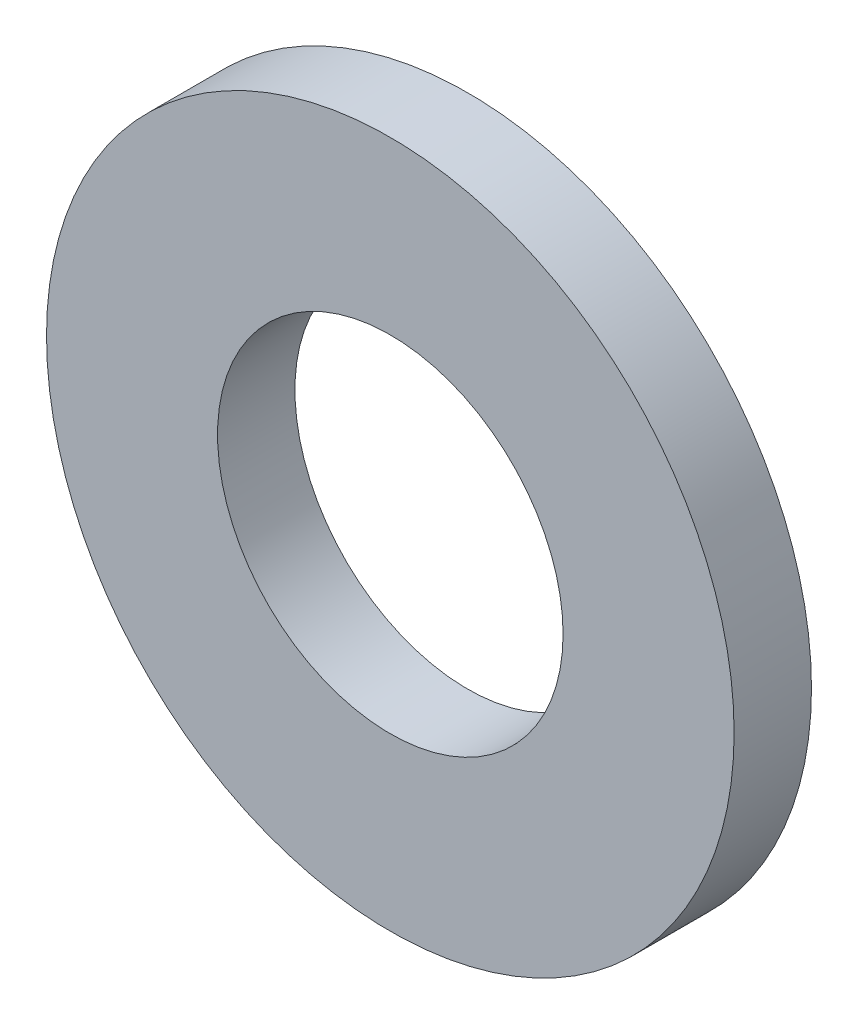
from build123d import *

# Parameters (mm, degrees)
ESQUISSE1_R      = 20
ESQUISSE1_R_2    = 10.05
EXTRUSION1_DEPTH = 4.5


with BuildPart() as part:
    # Esquisse1 → Extrusion1 (new body)
    with BuildSketch(Plane.XY):
        Circle(ESQUISSE1_R)
        Circle(ESQUISSE1_R_2, mode=Mode.SUBTRACT)
    extrude(amount=EXTRUSION1_DEPTH)


solid = part.part
